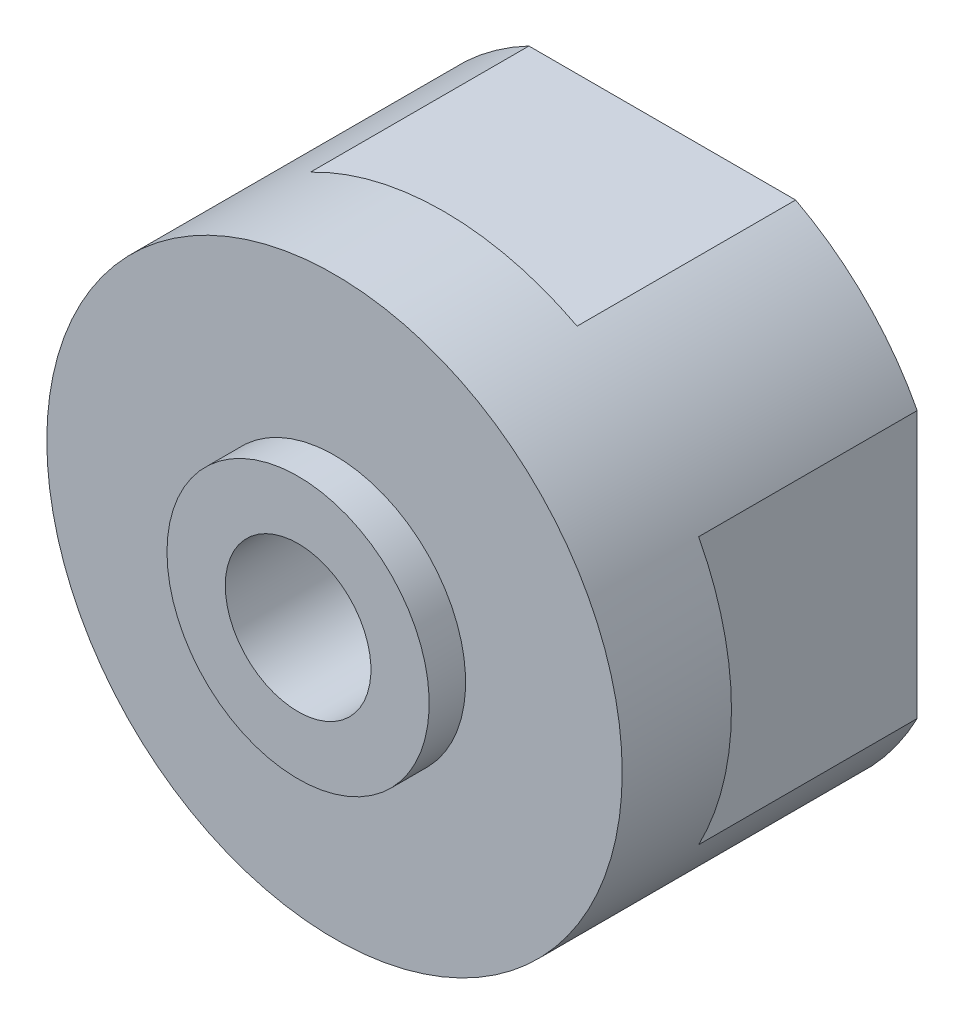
ISO-10303-21;
HEADER;
FILE_DESCRIPTION(('STEP AP214'),'2;1');
FILE_NAME('part.step','',(''),(''),'','','');
FILE_SCHEMA(('AUTOMOTIVE_DESIGN { 1 0 10303 214 1 1 1 1 }'));
ENDSEC;
DATA;
#1=APPLICATION_CONTEXT('core data for automotive mechanical design processes');
#2=APPLICATION_PROTOCOL_DEFINITION('international standard','automotive_design',2000,#1);
#3=PRODUCT_CONTEXT('',#1,'mechanical');
#4=PRODUCT('Part','Part','',(#3));
#5=PRODUCT_RELATED_PRODUCT_CATEGORY('part','',(#4));
#6=PRODUCT_DEFINITION_FORMATION('','',#4);
#7=PRODUCT_DEFINITION_CONTEXT('part definition',#1,'design');
#8=PRODUCT_DEFINITION('design','',#6,#7);
#9=PRODUCT_DEFINITION_SHAPE('','',#8);
#10=(LENGTH_UNIT() NAMED_UNIT(*) SI_UNIT(.MILLI.,.METRE.));
#11=(NAMED_UNIT(*) PLANE_ANGLE_UNIT() SI_UNIT($,.RADIAN.));
#12=(NAMED_UNIT(*) SI_UNIT($,.STERADIAN.) SOLID_ANGLE_UNIT());
#13=UNCERTAINTY_MEASURE_WITH_UNIT(LENGTH_MEASURE(1.E-05),#10,'distance_accuracy_value','');
#14=(GEOMETRIC_REPRESENTATION_CONTEXT(3) GLOBAL_UNCERTAINTY_ASSIGNED_CONTEXT((#13)) GLOBAL_UNIT_ASSIGNED_CONTEXT((#10,
#11,#12)) REPRESENTATION_CONTEXT('',''));
#15=CARTESIAN_POINT('',(0.,0.,0.));
#16=DIRECTION('',(0.,0.,1.));
#17=DIRECTION('',(1.,0.,0.));
#18=AXIS2_PLACEMENT_3D('',#15,#16,#17);
#19=CARTESIAN_POINT('',(0.,12.,22.7739019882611));
#20=DIRECTION('',(0.,0.,-1.));
#21=DIRECTION('',(-1.,0.,0.));
#22=AXIS2_PLACEMENT_3D('',#19,#20,#21);
#23=PLANE('',#22);
#24=DIRECTION('',(0.,1.,0.));
#25=VECTOR('',#24,1.);
#26=CARTESIAN_POINT('',(35.,-29.9722396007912,22.7739019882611));
#27=LINE('',#26,#25);
#28=CARTESIAN_POINT('',(35.,-18.3098334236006,22.7739019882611));
#29=VERTEX_POINT('',#28);
#30=CARTESIAN_POINT('',(35.,18.3098334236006,22.7739019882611));
#31=VERTEX_POINT('',#30);
#32=EDGE_CURVE('E127',#29,#31,#27,.T.);
#33=ORIENTED_EDGE('',*,*,#32,.F.);
#34=CARTESIAN_POINT('',(0.,0.,22.7739019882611));
#35=DIRECTION('',(0.,0.,-1.));
#36=DIRECTION('',(-1.,0.,0.));
#37=AXIS2_PLACEMENT_3D('',#34,#35,#36);
#38=CIRCLE('',#37,39.5);
#39=CARTESIAN_POINT('',(18.3098334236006,-35.,22.7739019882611));
#40=VERTEX_POINT('',#39);
#41=EDGE_CURVE('E137',#29,#40,#38,.T.);
#42=ORIENTED_EDGE('',*,*,#41,.T.);
#43=DIRECTION('',(1.,0.,0.));
#44=VECTOR('',#43,1.);
#45=CARTESIAN_POINT('',(-29.1005637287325,-35.,22.7739019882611));
#46=LINE('',#45,#44);
#47=CARTESIAN_POINT('',(-18.3098334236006,-35.,22.7739019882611));
#48=VERTEX_POINT('',#47);
#49=EDGE_CURVE('E288',#48,#40,#46,.T.);
#50=ORIENTED_EDGE('',*,*,#49,.F.);
#51=CARTESIAN_POINT('',(-35.,-18.3098334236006,22.7739019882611));
#52=VERTEX_POINT('',#51);
#53=EDGE_CURVE('E148',#48,#52,#38,.T.);
#54=ORIENTED_EDGE('',*,*,#53,.T.);
#55=DIRECTION('',(0.,-1.,0.));
#56=VECTOR('',#55,1.);
#57=CARTESIAN_POINT('',(-35.,31.7155913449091,22.7739019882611));
#58=LINE('',#57,#56);
#59=CARTESIAN_POINT('',(-35.,18.3098334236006,22.7739019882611));
#60=VERTEX_POINT('',#59);
#61=EDGE_CURVE('E287',#60,#52,#58,.T.);
#62=ORIENTED_EDGE('',*,*,#61,.F.);
#63=CARTESIAN_POINT('',(-18.3098334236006,35.,22.7739019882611));
#64=VERTEX_POINT('',#63);
#65=EDGE_CURVE('E151',#60,#64,#38,.T.);
#66=ORIENTED_EDGE('',*,*,#65,.T.);
#67=DIRECTION('',(-1.,0.,0.));
#68=VECTOR('',#67,1.);
#69=CARTESIAN_POINT('',(23.6023005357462,35.,22.7739019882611));
#70=LINE('',#69,#68);
#71=CARTESIAN_POINT('',(18.3098334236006,35.,22.7739019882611));
#72=VERTEX_POINT('',#71);
#73=EDGE_CURVE('E299',#72,#64,#70,.T.);
#74=ORIENTED_EDGE('',*,*,#73,.F.);
#75=EDGE_CURVE('E141',#72,#31,#38,.T.);
#76=ORIENTED_EDGE('',*,*,#75,.T.);
#77=EDGE_LOOP('',(#33,#42,#50,#54,#62,#66,#74,#76));
#78=FACE_BOUND('',#77,.T.);
#79=CARTESIAN_POINT('',(9.9000000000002,17.1473029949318,22.7739019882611));
#80=DIRECTION('',(0.,0.,-1.));
#81=DIRECTION('',(-1.,0.,0.));
#82=AXIS2_PLACEMENT_3D('',#79,#80,#81);
#83=CIRCLE('',#82,3.49999999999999);
#84=CARTESIAN_POINT('',(6.40000000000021,17.1473029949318,22.7739019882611));
#85=VERTEX_POINT('',#84);
#86=EDGE_CURVE('E305',#85,#85,#83,.T.);
#87=ORIENTED_EDGE('',*,*,#86,.F.);
#88=EDGE_LOOP('',(#87));
#89=FACE_BOUND('',#88,.T.);
#90=CARTESIAN_POINT('',(-9.89999999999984,17.147302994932,22.7739019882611));
#91=DIRECTION('',(0.,0.,-1.));
#92=DIRECTION('',(-1.,0.,0.));
#93=AXIS2_PLACEMENT_3D('',#90,#91,#92);
#94=CIRCLE('',#93,3.49999999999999);
#95=CARTESIAN_POINT('',(-13.3999999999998,17.147302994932,22.7739019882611));
#96=VERTEX_POINT('',#95);
#97=EDGE_CURVE('E313',#96,#96,#94,.T.);
#98=ORIENTED_EDGE('',*,*,#97,.F.);
#99=EDGE_LOOP('',(#98));
#100=FACE_BOUND('',#99,.T.);
#101=CARTESIAN_POINT('',(-19.8,0.,22.7739019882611));
#102=DIRECTION('',(0.,0.,-1.));
#103=DIRECTION('',(-1.,0.,0.));
#104=AXIS2_PLACEMENT_3D('',#101,#102,#103);
#105=CIRCLE('',#104,3.49999999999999);
#106=CARTESIAN_POINT('',(-23.3,0.,22.7739019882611));
#107=VERTEX_POINT('',#106);
#108=EDGE_CURVE('E319',#107,#107,#105,.T.);
#109=ORIENTED_EDGE('',*,*,#108,.F.);
#110=EDGE_LOOP('',(#109));
#111=FACE_BOUND('',#110,.T.);
#112=CARTESIAN_POINT('',(-9.90000000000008,-17.1473029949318,22.7739019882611));
#113=DIRECTION('',(0.,0.,-1.));
#114=DIRECTION('',(-1.,0.,0.));
#115=AXIS2_PLACEMENT_3D('',#112,#113,#114);
#116=CIRCLE('',#115,3.49999999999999);
#117=CARTESIAN_POINT('',(-13.4000000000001,-17.1473029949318,22.7739019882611));
#118=VERTEX_POINT('',#117);
#119=EDGE_CURVE('E325',#118,#118,#116,.T.);
#120=ORIENTED_EDGE('',*,*,#119,.F.);
#121=EDGE_LOOP('',(#120));
#122=FACE_BOUND('',#121,.T.);
#123=CARTESIAN_POINT('',(9.89999999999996,-17.1473029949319,22.7739019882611));
#124=DIRECTION('',(0.,0.,-1.));
#125=DIRECTION('',(-1.,0.,0.));
#126=AXIS2_PLACEMENT_3D('',#123,#124,#125);
#127=CIRCLE('',#126,3.49999999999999);
#128=CARTESIAN_POINT('',(6.39999999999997,-17.1473029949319,22.7739019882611));
#129=VERTEX_POINT('',#128);
#130=EDGE_CURVE('E331',#129,#129,#127,.T.);
#131=ORIENTED_EDGE('',*,*,#130,.F.);
#132=EDGE_LOOP('',(#131));
#133=FACE_BOUND('',#132,.T.);
#134=CARTESIAN_POINT('',(19.8,0.,22.7739019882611));
#135=DIRECTION('',(0.,0.,-1.));
#136=DIRECTION('',(-1.,0.,0.));
#137=AXIS2_PLACEMENT_3D('',#134,#135,#136);
#138=CIRCLE('',#137,3.49999999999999);
#139=CARTESIAN_POINT('',(16.3,0.,22.7739019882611));
#140=VERTEX_POINT('',#139);
#141=EDGE_CURVE('E337',#140,#140,#138,.T.);
#142=ORIENTED_EDGE('',*,*,#141,.F.);
#143=EDGE_LOOP('',(#142));
#144=FACE_BOUND('',#143,.T.);
#145=CARTESIAN_POINT('',(0.,0.,22.7739019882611));
#146=DIRECTION('',(0.,0.,-1.));
#147=DIRECTION('',(-1.,0.,0.));
#148=AXIS2_PLACEMENT_3D('',#145,#146,#147);
#149=CIRCLE('',#148,12.);
#150=CARTESIAN_POINT('',(-12.,0.,22.7739019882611));
#151=VERTEX_POINT('',#150);
#152=EDGE_CURVE('E343',#151,#151,#149,.T.);
#153=ORIENTED_EDGE('',*,*,#152,.F.);
#154=EDGE_LOOP('',(#153));
#155=FACE_BOUND('',#154,.T.);
#156=ADVANCED_FACE('F45',(#78,#89,#100,#111,#122,#133,#144,#155),#23,.T.);
#157=CARTESIAN_POINT('',(0.,0.,0.));
#158=DIRECTION('',(0.,0.,-1.));
#159=DIRECTION('',(-1.,0.,0.));
#160=AXIS2_PLACEMENT_3D('',#157,#158,#159);
#161=CYLINDRICAL_SURFACE('',#160,39.5);
#162=DIRECTION('',(0.,0.,-1.));
#163=VECTOR('',#162,1.);
#164=CARTESIAN_POINT('',(35.,18.3098334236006,0.));
#165=LINE('',#164,#163);
#166=CARTESIAN_POINT('',(35.,18.3098334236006,52.7739019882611));
#167=VERTEX_POINT('',#166);
#168=EDGE_CURVE('E13',#31,#167,#165,.F.);
#169=ORIENTED_EDGE('',*,*,#168,.F.);
#170=ORIENTED_EDGE('',*,*,#75,.F.);
#171=DIRECTION('',(0.,0.,-1.));
#172=VECTOR('',#171,1.);
#173=CARTESIAN_POINT('',(18.3098334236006,35.,0.));
#174=LINE('',#173,#172);
#175=CARTESIAN_POINT('',(18.3098334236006,35.,52.7739019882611));
#176=VERTEX_POINT('',#175);
#177=EDGE_CURVE('E158',#176,#72,#174,.T.);
#178=ORIENTED_EDGE('',*,*,#177,.F.);
#179=CARTESIAN_POINT('',(0.,0.,52.7739019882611));
#180=DIRECTION('',(0.,0.,-1.));
#181=DIRECTION('',(-1.,0.,0.));
#182=AXIS2_PLACEMENT_3D('',#179,#180,#181);
#183=CIRCLE('',#182,39.5);
#184=CARTESIAN_POINT('',(-18.3098334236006,35.,52.7739019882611));
#185=VERTEX_POINT('',#184);
#186=EDGE_CURVE('E150',#176,#185,#183,.F.);
#187=ORIENTED_EDGE('',*,*,#186,.T.);
#188=DIRECTION('',(0.,0.,-1.));
#189=VECTOR('',#188,1.);
#190=CARTESIAN_POINT('',(-18.3098334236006,35.,0.));
#191=LINE('',#190,#189);
#192=EDGE_CURVE('E160',#64,#185,#191,.F.);
#193=ORIENTED_EDGE('',*,*,#192,.F.);
#194=ORIENTED_EDGE('',*,*,#65,.F.);
#195=DIRECTION('',(0.,0.,-1.));
#196=VECTOR('',#195,1.);
#197=CARTESIAN_POINT('',(-35.,18.3098334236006,0.));
#198=LINE('',#197,#196);
#199=CARTESIAN_POINT('',(-35.,18.3098334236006,52.7739019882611));
#200=VERTEX_POINT('',#199);
#201=EDGE_CURVE('E166',#200,#60,#198,.T.);
#202=ORIENTED_EDGE('',*,*,#201,.F.);
#203=CARTESIAN_POINT('',(0.,0.,52.7739019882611));
#204=DIRECTION('',(0.,0.,-1.));
#205=DIRECTION('',(-1.,0.,0.));
#206=AXIS2_PLACEMENT_3D('',#203,#204,#205);
#207=CIRCLE('',#206,39.5);
#208=CARTESIAN_POINT('',(-35.,-18.3098334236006,52.7739019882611));
#209=VERTEX_POINT('',#208);
#210=EDGE_CURVE('E163',#200,#209,#207,.F.);
#211=ORIENTED_EDGE('',*,*,#210,.T.);
#212=DIRECTION('',(0.,0.,-1.));
#213=VECTOR('',#212,1.);
#214=CARTESIAN_POINT('',(-35.,-18.3098334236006,0.));
#215=LINE('',#214,#213);
#216=EDGE_CURVE('E168',#52,#209,#215,.F.);
#217=ORIENTED_EDGE('',*,*,#216,.F.);
#218=ORIENTED_EDGE('',*,*,#53,.F.);
#219=DIRECTION('',(0.,0.,-1.));
#220=VECTOR('',#219,1.);
#221=CARTESIAN_POINT('',(-18.3098334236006,-35.,0.));
#222=LINE('',#221,#220);
#223=CARTESIAN_POINT('',(-18.3098334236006,-35.,52.7739019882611));
#224=VERTEX_POINT('',#223);
#225=EDGE_CURVE('E173',#224,#48,#222,.T.);
#226=ORIENTED_EDGE('',*,*,#225,.F.);
#227=CARTESIAN_POINT('',(0.,0.,52.7739019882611));
#228=DIRECTION('',(0.,0.,1.));
#229=DIRECTION('',(1.,0.,0.));
#230=AXIS2_PLACEMENT_3D('',#227,#228,#229);
#231=CIRCLE('',#230,39.5);
#232=CARTESIAN_POINT('',(18.3098334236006,-35.,52.7739019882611));
#233=VERTEX_POINT('',#232);
#234=EDGE_CURVE('E171',#233,#224,#231,.F.);
#235=ORIENTED_EDGE('',*,*,#234,.F.);
#236=DIRECTION('',(0.,0.,-1.));
#237=VECTOR('',#236,1.);
#238=CARTESIAN_POINT('',(18.3098334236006,-35.,0.));
#239=LINE('',#238,#237);
#240=EDGE_CURVE('E147',#40,#233,#239,.F.);
#241=ORIENTED_EDGE('',*,*,#240,.F.);
#242=ORIENTED_EDGE('',*,*,#41,.F.);
#243=DIRECTION('',(0.,0.,-1.));
#244=VECTOR('',#243,1.);
#245=CARTESIAN_POINT('',(35.,-18.3098334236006,0.));
#246=LINE('',#245,#244);
#247=CARTESIAN_POINT('',(35.,-18.3098334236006,52.7739019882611));
#248=VERTEX_POINT('',#247);
#249=EDGE_CURVE('E52',#248,#29,#246,.T.);
#250=ORIENTED_EDGE('',*,*,#249,.F.);
#251=CARTESIAN_POINT('',(0.,0.,52.7739019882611));
#252=DIRECTION('',(0.,0.,-1.));
#253=DIRECTION('',(-1.,0.,0.));
#254=AXIS2_PLACEMENT_3D('',#251,#252,#253);
#255=CIRCLE('',#254,39.5);
#256=EDGE_CURVE('E132',#248,#167,#255,.F.);
#257=ORIENTED_EDGE('',*,*,#256,.T.);
#258=EDGE_LOOP('',(#169,#170,#178,#187,#193,#194,#202,#211,#217,#218,#226,#235,#241,#242,#250,#257));
#259=FACE_BOUND('',#258,.T.);
#260=CARTESIAN_POINT('',(0.,0.,67.7739019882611));
#261=DIRECTION('',(0.,0.,-1.));
#262=DIRECTION('',(-1.,0.,0.));
#263=AXIS2_PLACEMENT_3D('',#260,#261,#262);
#264=CIRCLE('',#263,39.5);
#265=CARTESIAN_POINT('',(-39.5,0.,67.7739019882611));
#266=VERTEX_POINT('',#265);
#267=EDGE_CURVE('E154',#266,#266,#264,.T.);
#268=ORIENTED_EDGE('',*,*,#267,.T.);
#269=EDGE_LOOP('',(#268));
#270=FACE_BOUND('',#269,.T.);
#271=ADVANCED_FACE('F144',(#259,#270),#161,.T.);
#272=CARTESIAN_POINT('',(0.,39.5,67.7739019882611));
#273=DIRECTION('',(0.,0.,1.));
#274=DIRECTION('',(1.,0.,0.));
#275=AXIS2_PLACEMENT_3D('',#272,#273,#274);
#276=PLANE('',#275);
#277=CARTESIAN_POINT('',(0.,0.,67.7739019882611));
#278=DIRECTION('',(0.,0.,-1.));
#279=DIRECTION('',(-1.,0.,0.));
#280=AXIS2_PLACEMENT_3D('',#277,#278,#279);
#281=CIRCLE('',#280,18.);
#282=CARTESIAN_POINT('',(-18.,0.,67.7739019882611));
#283=VERTEX_POINT('',#282);
#284=EDGE_CURVE('E357',#283,#283,#281,.T.);
#285=ORIENTED_EDGE('',*,*,#284,.T.);
#286=EDGE_LOOP('',(#285));
#287=FACE_BOUND('',#286,.T.);
#288=ORIENTED_EDGE('',*,*,#267,.F.);
#289=EDGE_LOOP('',(#288));
#290=FACE_BOUND('',#289,.T.);
#291=ADVANCED_FACE('F188',(#287,#290),#276,.T.);
#292=CARTESIAN_POINT('',(0.,0.,0.));
#293=DIRECTION('',(0.,0.,-1.));
#294=DIRECTION('',(-1.,0.,0.));
#295=AXIS2_PLACEMENT_3D('',#292,#293,#294);
#296=CYLINDRICAL_SURFACE('',#295,18.);
#297=CARTESIAN_POINT('',(0.,0.,72.7739019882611));
#298=DIRECTION('',(0.,0.,-1.));
#299=DIRECTION('',(-1.,0.,0.));
#300=AXIS2_PLACEMENT_3D('',#297,#298,#299);
#301=CIRCLE('',#300,18.);
#302=CARTESIAN_POINT('',(-18.,0.,72.7739019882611));
#303=VERTEX_POINT('',#302);
#304=EDGE_CURVE('E355',#303,#303,#301,.T.);
#305=ORIENTED_EDGE('',*,*,#304,.T.);
#306=EDGE_LOOP('',(#305));
#307=FACE_BOUND('',#306,.T.);
#308=ORIENTED_EDGE('',*,*,#284,.F.);
#309=EDGE_LOOP('',(#308));
#310=FACE_BOUND('',#309,.T.);
#311=ADVANCED_FACE('F192',(#307,#310),#296,.T.);
#312=CARTESIAN_POINT('',(0.,18.,72.7739019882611));
#313=DIRECTION('',(0.,0.,1.));
#314=DIRECTION('',(1.,0.,0.));
#315=AXIS2_PLACEMENT_3D('',#312,#313,#314);
#316=PLANE('',#315);
#317=CARTESIAN_POINT('',(0.,0.,72.7739019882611));
#318=DIRECTION('',(0.,0.,-1.));
#319=DIRECTION('',(-1.,0.,0.));
#320=AXIS2_PLACEMENT_3D('',#317,#318,#319);
#321=CIRCLE('',#320,9.99999999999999);
#322=CARTESIAN_POINT('',(-9.99999999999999,0.,72.7739019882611));
#323=VERTEX_POINT('',#322);
#324=EDGE_CURVE('E352',#323,#323,#321,.T.);
#325=ORIENTED_EDGE('',*,*,#324,.T.);
#326=EDGE_LOOP('',(#325));
#327=FACE_BOUND('',#326,.T.);
#328=ORIENTED_EDGE('',*,*,#304,.F.);
#329=EDGE_LOOP('',(#328));
#330=FACE_BOUND('',#329,.T.);
#331=ADVANCED_FACE('F198',(#327,#330),#316,.T.);
#332=CARTESIAN_POINT('',(0.,0.,0.));
#333=DIRECTION('',(0.,0.,-1.));
#334=DIRECTION('',(-1.,0.,0.));
#335=AXIS2_PLACEMENT_3D('',#332,#333,#334);
#336=CYLINDRICAL_SURFACE('',#335,9.99999999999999);
#337=CARTESIAN_POINT('',(0.,0.,42.7739019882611));
#338=DIRECTION('',(0.,0.,-1.));
#339=DIRECTION('',(-1.,0.,0.));
#340=AXIS2_PLACEMENT_3D('',#337,#338,#339);
#341=CIRCLE('',#340,9.99999999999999);
#342=CARTESIAN_POINT('',(-9.99999999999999,0.,42.7739019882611));
#343=VERTEX_POINT('',#342);
#344=EDGE_CURVE('E349',#343,#343,#341,.T.);
#345=ORIENTED_EDGE('',*,*,#344,.T.);
#346=EDGE_LOOP('',(#345));
#347=FACE_BOUND('',#346,.T.);
#348=ORIENTED_EDGE('',*,*,#324,.F.);
#349=EDGE_LOOP('',(#348));
#350=FACE_BOUND('',#349,.T.);
#351=ADVANCED_FACE('F202',(#347,#350),#336,.F.);
#352=CARTESIAN_POINT('',(0.,9.99999999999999,42.7739019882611));
#353=DIRECTION('',(0.,0.,-1.));
#354=DIRECTION('',(-1.,0.,0.));
#355=AXIS2_PLACEMENT_3D('',#352,#353,#354);
#356=PLANE('',#355);
#357=CARTESIAN_POINT('',(0.,0.,42.7739019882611));
#358=DIRECTION('',(0.,0.,-1.));
#359=DIRECTION('',(-1.,0.,0.));
#360=AXIS2_PLACEMENT_3D('',#357,#358,#359);
#361=CIRCLE('',#360,12.);
#362=CARTESIAN_POINT('',(-12.,0.,42.7739019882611));
#363=VERTEX_POINT('',#362);
#364=EDGE_CURVE('E346',#363,#363,#361,.T.);
#365=ORIENTED_EDGE('',*,*,#364,.T.);
#366=EDGE_LOOP('',(#365));
#367=FACE_BOUND('',#366,.T.);
#368=ORIENTED_EDGE('',*,*,#344,.F.);
#369=EDGE_LOOP('',(#368));
#370=FACE_BOUND('',#369,.T.);
#371=ADVANCED_FACE('F206',(#367,#370),#356,.T.);
#372=CARTESIAN_POINT('',(0.,0.,0.));
#373=DIRECTION('',(0.,0.,-1.));
#374=DIRECTION('',(-1.,0.,0.));
#375=AXIS2_PLACEMENT_3D('',#372,#373,#374);
#376=CYLINDRICAL_SURFACE('',#375,12.);
#377=ORIENTED_EDGE('',*,*,#152,.T.);
#378=EDGE_LOOP('',(#377));
#379=FACE_BOUND('',#378,.T.);
#380=ORIENTED_EDGE('',*,*,#364,.F.);
#381=EDGE_LOOP('',(#380));
#382=FACE_BOUND('',#381,.T.);
#383=ADVANCED_FACE('F210',(#379,#382),#376,.F.);
#384=CARTESIAN_POINT('',(19.8,0.,37.7739019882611));
#385=DIRECTION('',(0.,0.,-1.));
#386=DIRECTION('',(-1.,0.,0.));
#387=AXIS2_PLACEMENT_3D('',#384,#385,#386);
#388=CONICAL_SURFACE('',#387,3.49999999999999,1.02974425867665);
#389=CARTESIAN_POINT('',(19.8,0.,39.8769141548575));
#390=VERTEX_POINT('',#389);
#391=VERTEX_LOOP('',#390);
#392=FACE_BOUND('',#391,.T.);
#393=CARTESIAN_POINT('',(19.8,0.,37.7739019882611));
#394=DIRECTION('',(0.,0.,-1.));
#395=DIRECTION('',(-1.,0.,0.));
#396=AXIS2_PLACEMENT_3D('',#393,#394,#395);
#397=CIRCLE('',#396,3.49999999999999);
#398=CARTESIAN_POINT('',(16.3,0.,37.7739019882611));
#399=VERTEX_POINT('',#398);
#400=EDGE_CURVE('E340',#399,#399,#397,.T.);
#401=ORIENTED_EDGE('',*,*,#400,.T.);
#402=EDGE_LOOP('',(#401));
#403=FACE_BOUND('',#402,.T.);
#404=ADVANCED_FACE('F214',(#392,#403),#388,.F.);
#405=CARTESIAN_POINT('',(19.8,0.,22.7739019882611));
#406=DIRECTION('',(0.,0.,-1.));
#407=DIRECTION('',(-1.,0.,0.));
#408=AXIS2_PLACEMENT_3D('',#405,#406,#407);
#409=CYLINDRICAL_SURFACE('',#408,3.49999999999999);
#410=ORIENTED_EDGE('',*,*,#400,.F.);
#411=EDGE_LOOP('',(#410));
#412=FACE_BOUND('',#411,.T.);
#413=ORIENTED_EDGE('',*,*,#141,.T.);
#414=EDGE_LOOP('',(#413));
#415=FACE_BOUND('',#414,.T.);
#416=ADVANCED_FACE('F218',(#412,#415),#409,.F.);
#417=CARTESIAN_POINT('',(9.89999999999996,-17.1473029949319,37.7739019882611));
#418=DIRECTION('',(0.,0.,-1.));
#419=DIRECTION('',(-1.,0.,0.));
#420=AXIS2_PLACEMENT_3D('',#417,#418,#419);
#421=CONICAL_SURFACE('',#420,3.49999999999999,1.02974425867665);
#422=CARTESIAN_POINT('',(9.89999999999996,-17.1473029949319,39.8769141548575));
#423=VERTEX_POINT('',#422);
#424=VERTEX_LOOP('',#423);
#425=FACE_BOUND('',#424,.T.);
#426=CARTESIAN_POINT('',(9.89999999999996,-17.1473029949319,37.7739019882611));
#427=DIRECTION('',(0.,0.,-1.));
#428=DIRECTION('',(-1.,0.,0.));
#429=AXIS2_PLACEMENT_3D('',#426,#427,#428);
#430=CIRCLE('',#429,3.49999999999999);
#431=CARTESIAN_POINT('',(6.39999999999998,-17.1473029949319,37.7739019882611));
#432=VERTEX_POINT('',#431);
#433=EDGE_CURVE('E334',#432,#432,#430,.T.);
#434=ORIENTED_EDGE('',*,*,#433,.T.);
#435=EDGE_LOOP('',(#434));
#436=FACE_BOUND('',#435,.T.);
#437=ADVANCED_FACE('F222',(#425,#436),#421,.F.);
#438=CARTESIAN_POINT('',(9.89999999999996,-17.1473029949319,22.7739019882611));
#439=DIRECTION('',(0.,0.,-1.));
#440=DIRECTION('',(-1.,0.,0.));
#441=AXIS2_PLACEMENT_3D('',#438,#439,#440);
#442=CYLINDRICAL_SURFACE('',#441,3.49999999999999);
#443=ORIENTED_EDGE('',*,*,#433,.F.);
#444=EDGE_LOOP('',(#443));
#445=FACE_BOUND('',#444,.T.);
#446=ORIENTED_EDGE('',*,*,#130,.T.);
#447=EDGE_LOOP('',(#446));
#448=FACE_BOUND('',#447,.T.);
#449=ADVANCED_FACE('F226',(#445,#448),#442,.F.);
#450=CARTESIAN_POINT('',(-9.90000000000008,-17.1473029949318,37.7739019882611));
#451=DIRECTION('',(0.,0.,-1.));
#452=DIRECTION('',(-1.,0.,0.));
#453=AXIS2_PLACEMENT_3D('',#450,#451,#452);
#454=CONICAL_SURFACE('',#453,3.49999999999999,1.02974425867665);
#455=CARTESIAN_POINT('',(-9.90000000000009,-17.1473029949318,39.8769141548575));
#456=VERTEX_POINT('',#455);
#457=VERTEX_LOOP('',#456);
#458=FACE_BOUND('',#457,.T.);
#459=CARTESIAN_POINT('',(-9.90000000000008,-17.1473029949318,37.7739019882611));
#460=DIRECTION('',(0.,0.,-1.));
#461=DIRECTION('',(-1.,0.,0.));
#462=AXIS2_PLACEMENT_3D('',#459,#460,#461);
#463=CIRCLE('',#462,3.49999999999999);
#464=CARTESIAN_POINT('',(-13.4000000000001,-17.1473029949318,37.7739019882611));
#465=VERTEX_POINT('',#464);
#466=EDGE_CURVE('E328',#465,#465,#463,.T.);
#467=ORIENTED_EDGE('',*,*,#466,.T.);
#468=EDGE_LOOP('',(#467));
#469=FACE_BOUND('',#468,.T.);
#470=ADVANCED_FACE('F230',(#458,#469),#454,.F.);
#471=CARTESIAN_POINT('',(-9.90000000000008,-17.1473029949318,22.7739019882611));
#472=DIRECTION('',(0.,0.,-1.));
#473=DIRECTION('',(-1.,0.,0.));
#474=AXIS2_PLACEMENT_3D('',#471,#472,#473);
#475=CYLINDRICAL_SURFACE('',#474,3.49999999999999);
#476=ORIENTED_EDGE('',*,*,#466,.F.);
#477=EDGE_LOOP('',(#476));
#478=FACE_BOUND('',#477,.T.);
#479=ORIENTED_EDGE('',*,*,#119,.T.);
#480=EDGE_LOOP('',(#479));
#481=FACE_BOUND('',#480,.T.);
#482=ADVANCED_FACE('F234',(#478,#481),#475,.F.);
#483=CARTESIAN_POINT('',(-19.8,0.,37.7739019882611));
#484=DIRECTION('',(0.,0.,-1.));
#485=DIRECTION('',(-1.,0.,0.));
#486=AXIS2_PLACEMENT_3D('',#483,#484,#485);
#487=CONICAL_SURFACE('',#486,3.49999999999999,1.02974425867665);
#488=CARTESIAN_POINT('',(-19.8,0.,39.8769141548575));
#489=VERTEX_POINT('',#488);
#490=VERTEX_LOOP('',#489);
#491=FACE_BOUND('',#490,.T.);
#492=CARTESIAN_POINT('',(-19.8,0.,37.7739019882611));
#493=DIRECTION('',(0.,0.,-1.));
#494=DIRECTION('',(-1.,0.,0.));
#495=AXIS2_PLACEMENT_3D('',#492,#493,#494);
#496=CIRCLE('',#495,3.49999999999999);
#497=CARTESIAN_POINT('',(-23.3,0.,37.7739019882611));
#498=VERTEX_POINT('',#497);
#499=EDGE_CURVE('E322',#498,#498,#496,.T.);
#500=ORIENTED_EDGE('',*,*,#499,.T.);
#501=EDGE_LOOP('',(#500));
#502=FACE_BOUND('',#501,.T.);
#503=ADVANCED_FACE('F238',(#491,#502),#487,.F.);
#504=CARTESIAN_POINT('',(-19.8,0.,22.7739019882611));
#505=DIRECTION('',(0.,0.,-1.));
#506=DIRECTION('',(-1.,0.,0.));
#507=AXIS2_PLACEMENT_3D('',#504,#505,#506);
#508=CYLINDRICAL_SURFACE('',#507,3.49999999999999);
#509=ORIENTED_EDGE('',*,*,#499,.F.);
#510=EDGE_LOOP('',(#509));
#511=FACE_BOUND('',#510,.T.);
#512=ORIENTED_EDGE('',*,*,#108,.T.);
#513=EDGE_LOOP('',(#512));
#514=FACE_BOUND('',#513,.T.);
#515=ADVANCED_FACE('F242',(#511,#514),#508,.F.);
#516=CARTESIAN_POINT('',(-9.89999999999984,17.147302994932,37.7739019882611));
#517=DIRECTION('',(0.,0.,-1.));
#518=DIRECTION('',(-1.,0.,0.));
#519=AXIS2_PLACEMENT_3D('',#516,#517,#518);
#520=CONICAL_SURFACE('',#519,3.49999999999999,1.02974425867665);
#521=CARTESIAN_POINT('',(-9.89999999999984,17.147302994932,39.8769141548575));
#522=VERTEX_POINT('',#521);
#523=VERTEX_LOOP('',#522);
#524=FACE_BOUND('',#523,.T.);
#525=CARTESIAN_POINT('',(-9.89999999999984,17.147302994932,37.7739019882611));
#526=DIRECTION('',(0.,0.,-1.));
#527=DIRECTION('',(-1.,0.,0.));
#528=AXIS2_PLACEMENT_3D('',#525,#526,#527);
#529=CIRCLE('',#528,3.49999999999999);
#530=CARTESIAN_POINT('',(-13.3999999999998,17.147302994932,37.7739019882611));
#531=VERTEX_POINT('',#530);
#532=EDGE_CURVE('E316',#531,#531,#529,.T.);
#533=ORIENTED_EDGE('',*,*,#532,.T.);
#534=EDGE_LOOP('',(#533));
#535=FACE_BOUND('',#534,.T.);
#536=ADVANCED_FACE('F246',(#524,#535),#520,.F.);
#537=CARTESIAN_POINT('',(-9.89999999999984,17.147302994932,22.7739019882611));
#538=DIRECTION('',(0.,0.,-1.));
#539=DIRECTION('',(-1.,0.,0.));
#540=AXIS2_PLACEMENT_3D('',#537,#538,#539);
#541=CYLINDRICAL_SURFACE('',#540,3.49999999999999);
#542=ORIENTED_EDGE('',*,*,#532,.F.);
#543=EDGE_LOOP('',(#542));
#544=FACE_BOUND('',#543,.T.);
#545=ORIENTED_EDGE('',*,*,#97,.T.);
#546=EDGE_LOOP('',(#545));
#547=FACE_BOUND('',#546,.T.);
#548=ADVANCED_FACE('F250',(#544,#547),#541,.F.);
#549=CARTESIAN_POINT('',(9.9000000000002,17.1473029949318,37.7739019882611));
#550=DIRECTION('',(0.,0.,-1.));
#551=DIRECTION('',(-1.,0.,0.));
#552=AXIS2_PLACEMENT_3D('',#549,#550,#551);
#553=CONICAL_SURFACE('',#552,3.49999999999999,1.02974425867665);
#554=CARTESIAN_POINT('',(9.9000000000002,17.1473029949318,39.8769141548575));
#555=VERTEX_POINT('',#554);
#556=VERTEX_LOOP('',#555);
#557=FACE_BOUND('',#556,.T.);
#558=CARTESIAN_POINT('',(9.9000000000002,17.1473029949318,37.7739019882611));
#559=DIRECTION('',(0.,0.,-1.));
#560=DIRECTION('',(-1.,0.,0.));
#561=AXIS2_PLACEMENT_3D('',#558,#559,#560);
#562=CIRCLE('',#561,3.49999999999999);
#563=CARTESIAN_POINT('',(6.40000000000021,17.1473029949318,37.7739019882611));
#564=VERTEX_POINT('',#563);
#565=EDGE_CURVE('E310',#564,#564,#562,.T.);
#566=ORIENTED_EDGE('',*,*,#565,.T.);
#567=EDGE_LOOP('',(#566));
#568=FACE_BOUND('',#567,.T.);
#569=ADVANCED_FACE('F254',(#557,#568),#553,.F.);
#570=CARTESIAN_POINT('',(9.9000000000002,17.1473029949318,22.7739019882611));
#571=DIRECTION('',(0.,0.,-1.));
#572=DIRECTION('',(-1.,0.,0.));
#573=AXIS2_PLACEMENT_3D('',#570,#571,#572);
#574=CYLINDRICAL_SURFACE('',#573,3.49999999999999);
#575=ORIENTED_EDGE('',*,*,#565,.F.);
#576=EDGE_LOOP('',(#575));
#577=FACE_BOUND('',#576,.T.);
#578=ORIENTED_EDGE('',*,*,#86,.T.);
#579=EDGE_LOOP('',(#578));
#580=FACE_BOUND('',#579,.T.);
#581=ADVANCED_FACE('F258',(#577,#580),#574,.F.);
#582=CARTESIAN_POINT('',(23.6023005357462,35.,52.7739019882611));
#583=DIRECTION('',(0.,-1.,0.));
#584=DIRECTION('',(0.,0.,-1.));
#585=AXIS2_PLACEMENT_3D('',#582,#583,#584);
#586=PLANE('',#585);
#587=ORIENTED_EDGE('',*,*,#192,.T.);
#588=DIRECTION('',(-1.,0.,0.));
#589=VECTOR('',#588,1.);
#590=CARTESIAN_POINT('',(23.6023005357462,35.,52.7739019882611));
#591=LINE('',#590,#589);
#592=EDGE_CURVE('E303',#176,#185,#591,.T.);
#593=ORIENTED_EDGE('',*,*,#592,.F.);
#594=ORIENTED_EDGE('',*,*,#177,.T.);
#595=ORIENTED_EDGE('',*,*,#73,.T.);
#596=EDGE_LOOP('',(#587,#593,#594,#595));
#597=FACE_BOUND('',#596,.T.);
#598=ADVANCED_FACE('F262',(#597),#586,.F.);
#599=CARTESIAN_POINT('',(23.6023005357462,35.,52.7739019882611));
#600=DIRECTION('',(0.,0.,-1.));
#601=DIRECTION('',(-1.,0.,0.));
#602=AXIS2_PLACEMENT_3D('',#599,#600,#601);
#603=PLANE('',#602);
#604=ORIENTED_EDGE('',*,*,#592,.T.);
#605=ORIENTED_EDGE('',*,*,#186,.F.);
#606=EDGE_LOOP('',(#604,#605));
#607=FACE_BOUND('',#606,.T.);
#608=ADVANCED_FACE('F266',(#607),#603,.T.);
#609=CARTESIAN_POINT('',(-35.,31.7155913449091,52.7739019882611));
#610=DIRECTION('',(1.,0.,0.));
#611=DIRECTION('',(0.,1.,0.));
#612=AXIS2_PLACEMENT_3D('',#609,#610,#611);
#613=PLANE('',#612);
#614=ORIENTED_EDGE('',*,*,#216,.T.);
#615=DIRECTION('',(0.,-1.,0.));
#616=VECTOR('',#615,1.);
#617=CARTESIAN_POINT('',(-35.,31.7155913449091,52.7739019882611));
#618=LINE('',#617,#616);
#619=EDGE_CURVE('E297',#200,#209,#618,.T.);
#620=ORIENTED_EDGE('',*,*,#619,.F.);
#621=ORIENTED_EDGE('',*,*,#201,.T.);
#622=ORIENTED_EDGE('',*,*,#61,.T.);
#623=EDGE_LOOP('',(#614,#620,#621,#622));
#624=FACE_BOUND('',#623,.T.);
#625=ADVANCED_FACE('F270',(#624),#613,.F.);
#626=CARTESIAN_POINT('',(-35.,-40.9687659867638,52.7739019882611));
#627=DIRECTION('',(0.,0.,-1.));
#628=DIRECTION('',(-1.,0.,0.));
#629=AXIS2_PLACEMENT_3D('',#626,#627,#628);
#630=PLANE('',#629);
#631=ORIENTED_EDGE('',*,*,#619,.T.);
#632=ORIENTED_EDGE('',*,*,#210,.F.);
#633=EDGE_LOOP('',(#631,#632));
#634=FACE_BOUND('',#633,.T.);
#635=ADVANCED_FACE('F274',(#634),#630,.T.);
#636=CARTESIAN_POINT('',(-29.1005637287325,-35.,52.7739019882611));
#637=DIRECTION('',(0.,1.,0.));
#638=DIRECTION('',(-1.,0.,0.));
#639=AXIS2_PLACEMENT_3D('',#636,#637,#638);
#640=PLANE('',#639);
#641=ORIENTED_EDGE('',*,*,#240,.T.);
#642=DIRECTION('',(1.,0.,0.));
#643=VECTOR('',#642,1.);
#644=CARTESIAN_POINT('',(-29.1005637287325,-35.,52.7739019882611));
#645=LINE('',#644,#643);
#646=EDGE_CURVE('E64',#224,#233,#645,.T.);
#647=ORIENTED_EDGE('',*,*,#646,.F.);
#648=ORIENTED_EDGE('',*,*,#225,.T.);
#649=ORIENTED_EDGE('',*,*,#49,.T.);
#650=EDGE_LOOP('',(#641,#647,#648,#649));
#651=FACE_BOUND('',#650,.T.);
#652=ADVANCED_FACE('F278',(#651),#640,.F.);
#653=CARTESIAN_POINT('',(-29.1005637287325,-48.0080860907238,52.7739019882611));
#654=DIRECTION('',(0.,0.,1.));
#655=DIRECTION('',(1.,0.,0.));
#656=AXIS2_PLACEMENT_3D('',#653,#654,#655);
#657=PLANE('',#656);
#658=ORIENTED_EDGE('',*,*,#234,.T.);
#659=ORIENTED_EDGE('',*,*,#646,.T.);
#660=EDGE_LOOP('',(#658,#659));
#661=FACE_BOUND('',#660,.T.);
#662=ADVANCED_FACE('F182',(#661),#657,.F.);
#663=CARTESIAN_POINT('',(35.,-29.9722396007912,52.7739019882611));
#664=DIRECTION('',(-1.,0.,0.));
#665=DIRECTION('',(0.,0.,1.));
#666=AXIS2_PLACEMENT_3D('',#663,#664,#665);
#667=PLANE('',#666);
#668=ORIENTED_EDGE('',*,*,#168,.T.);
#669=DIRECTION('',(0.,1.,0.));
#670=VECTOR('',#669,1.);
#671=CARTESIAN_POINT('',(35.,-29.9722396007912,52.7739019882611));
#672=LINE('',#671,#670);
#673=EDGE_CURVE('E58',#248,#167,#672,.T.);
#674=ORIENTED_EDGE('',*,*,#673,.F.);
#675=ORIENTED_EDGE('',*,*,#249,.T.);
#676=ORIENTED_EDGE('',*,*,#32,.T.);
#677=EDGE_LOOP('',(#668,#674,#675,#676));
#678=FACE_BOUND('',#677,.T.);
#679=ADVANCED_FACE('F126',(#678),#667,.F.);
#680=CARTESIAN_POINT('',(35.,28.7653037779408,52.7739019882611));
#681=DIRECTION('',(0.,0.,-1.));
#682=DIRECTION('',(-1.,0.,0.));
#683=AXIS2_PLACEMENT_3D('',#680,#681,#682);
#684=PLANE('',#683);
#685=ORIENTED_EDGE('',*,*,#673,.T.);
#686=ORIENTED_EDGE('',*,*,#256,.F.);
#687=EDGE_LOOP('',(#685,#686));
#688=FACE_BOUND('',#687,.T.);
#689=ADVANCED_FACE('F176',(#688),#684,.T.);
#690=CLOSED_SHELL('',(#156,#271,#291,#311,#331,#351,#371,#383,#404,#416,#437,#449,#470,#482,
#503,#515,#536,#548,#569,#581,#598,#608,#625,#635,#652,#662,#679,#689));
#691=MANIFOLD_SOLID_BREP('B2',#690);
#692=ADVANCED_BREP_SHAPE_REPRESENTATION('',(#18,#691),#14);
#693=SHAPE_DEFINITION_REPRESENTATION(#9,#692);
ENDSEC;
END-ISO-10303-21;
